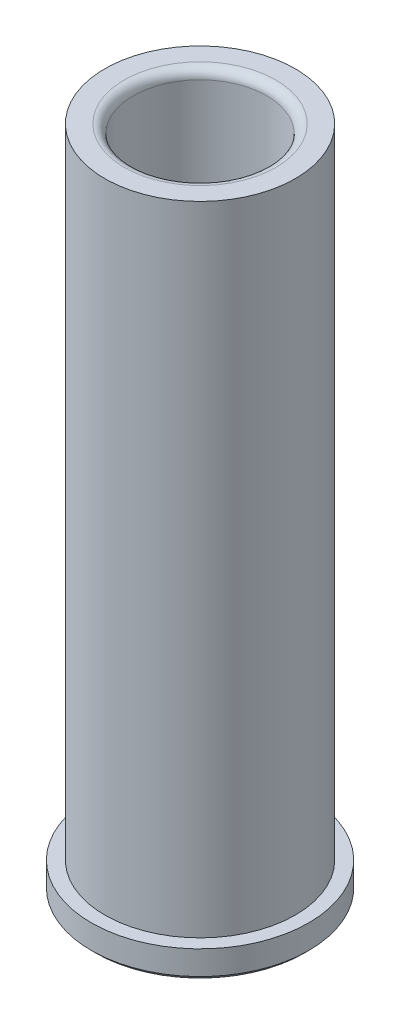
from build123d import *

# Parameters (mm, degrees)
FILLET1_R = 1.524


with BuildPart() as part:
    # Sketch1 → Revolve1 (revolve)
    with BuildSketch(Plane.XY, mode=Mode.PRIVATE) as revolve1_sk:
        Polygon((-17.3609, 0), (-18.1229, 0.762), (-18.1229, 4.7625), (-15.88135, 4.7625), (-15.88135, 111.125), (-11.11885, 111.125), (-11.11885, 0.762), (-11.88085, 0), align=None)
    revolve(revolve1_sk.sketch.rotate(Axis((0, -1000, 0), (0, 1, 0)), 180), axis=Axis((0, -1000, 0), (0, 1, 0)))

    # Fillet1
    fillet1_edges = [part.edges().sort_by_distance(p)[0] for p in [
        (-11.11885, 111.125, 0),
    ]]
    fillet(fillet1_edges, radius=FILLET1_R)


solid = part.part
